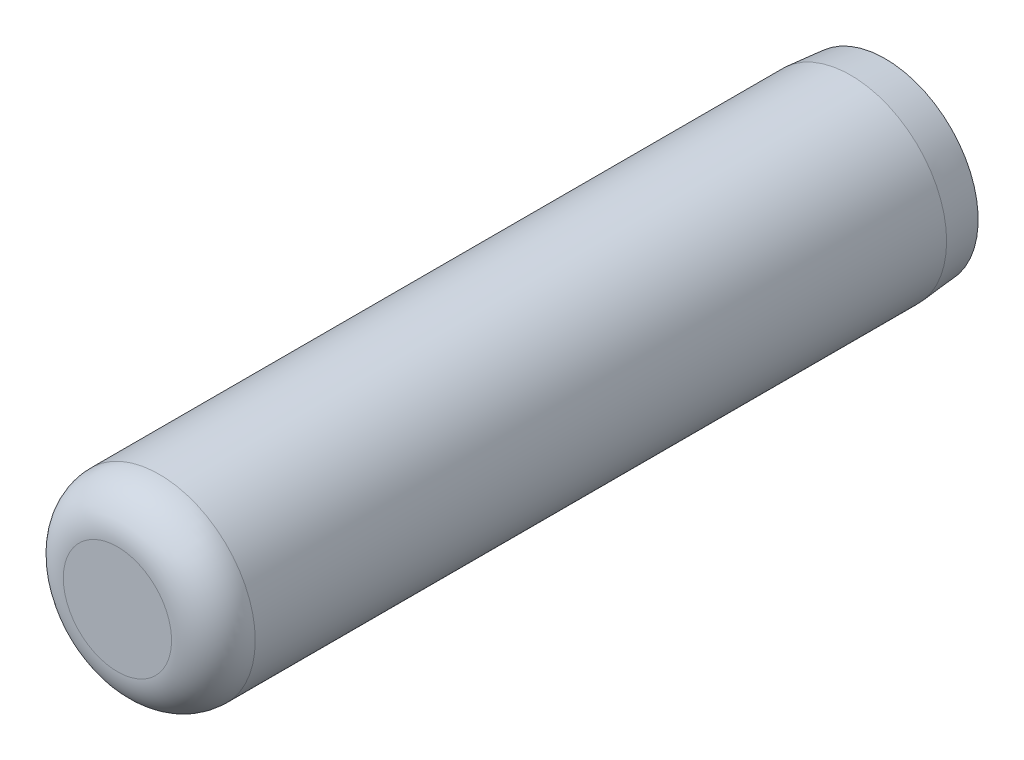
from build123d import *


with BuildPart() as part:
    # Logo3_bib1 → Revolve1 (revolve)
    with BuildSketch(Plane(origin=(0, 0, 0), x_dir=(-1, 0, 0), z_dir=(0, -1, 0))):
        with BuildLine():
            Line((0, 25.4), (0, -25.4))
            Line((0, -25.4), (3.5814, -25.4))
            ThreePointArc((3.5814, -25.4), (5.539095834, -24.589095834), (6.35, -22.6314))
            Line((6.35, -22.6314), (6.35, 23.114))
            Line((6.35, 23.114), (6.150000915, 25.4))
            Line((6.150000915, 25.4), (0, 25.4))
        make_face()
    revolve(axis=Axis((0, 0, -47.537203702), (0, 0, 1)))


solid = part.part
